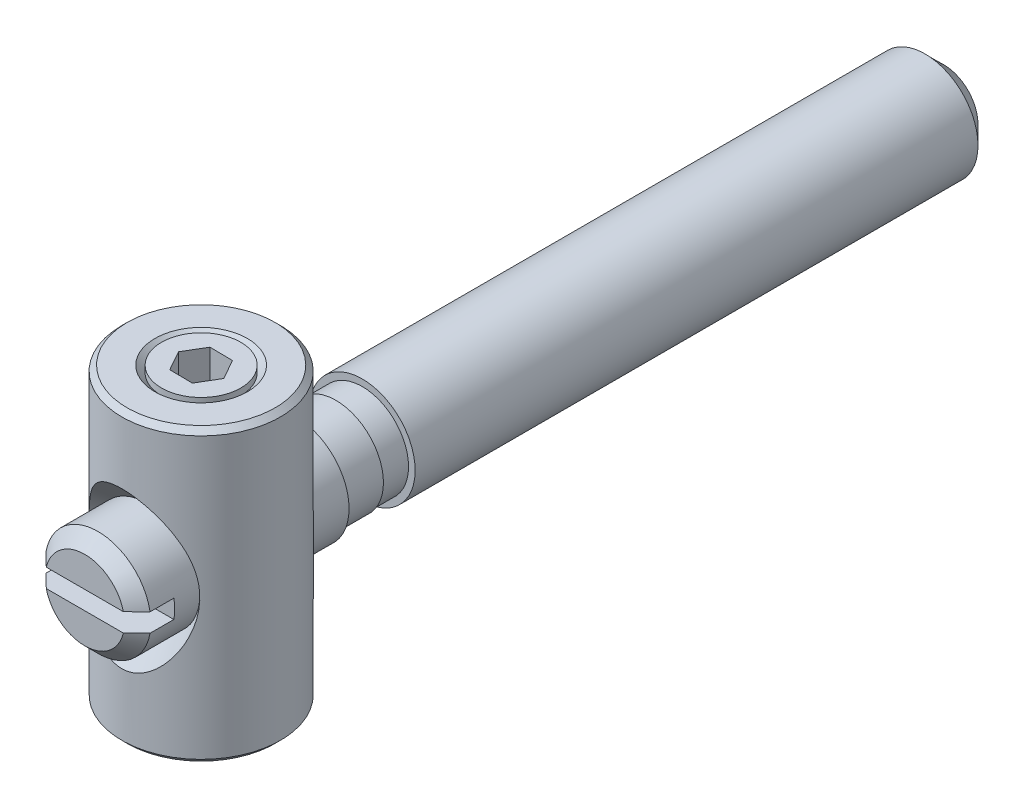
ISO-10303-21;
HEADER;
FILE_DESCRIPTION(('STEP AP214'),'2;1');
FILE_NAME('part.step','',(''),(''),'','','');
FILE_SCHEMA(('AUTOMOTIVE_DESIGN { 1 0 10303 214 1 1 1 1 }'));
ENDSEC;
DATA;
#1=APPLICATION_CONTEXT('core data for automotive mechanical design processes');
#2=APPLICATION_PROTOCOL_DEFINITION('international standard','automotive_design',2000,#1);
#3=PRODUCT_CONTEXT('',#1,'mechanical');
#4=PRODUCT('Part','Part','',(#3));
#5=PRODUCT_RELATED_PRODUCT_CATEGORY('part','',(#4));
#6=PRODUCT_DEFINITION_FORMATION('','',#4);
#7=PRODUCT_DEFINITION_CONTEXT('part definition',#1,'design');
#8=PRODUCT_DEFINITION('design','',#6,#7);
#9=PRODUCT_DEFINITION_SHAPE('','',#8);
#10=(LENGTH_UNIT() NAMED_UNIT(*) SI_UNIT(.MILLI.,.METRE.));
#11=(NAMED_UNIT(*) PLANE_ANGLE_UNIT() SI_UNIT($,.RADIAN.));
#12=(NAMED_UNIT(*) SI_UNIT($,.STERADIAN.) SOLID_ANGLE_UNIT());
#13=UNCERTAINTY_MEASURE_WITH_UNIT(LENGTH_MEASURE(1.E-05),#10,'distance_accuracy_value','');
#14=(GEOMETRIC_REPRESENTATION_CONTEXT(3) GLOBAL_UNCERTAINTY_ASSIGNED_CONTEXT((#13)) GLOBAL_UNIT_ASSIGNED_CONTEXT((#10,
#11,#12)) REPRESENTATION_CONTEXT('',''));
#15=CARTESIAN_POINT('',(0.,0.,0.));
#16=DIRECTION('',(0.,0.,1.));
#17=DIRECTION('',(1.,0.,0.));
#18=AXIS2_PLACEMENT_3D('',#15,#16,#17);
#19=CARTESIAN_POINT('',(0.,0.,34.697365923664));
#20=DIRECTION('',(0.,0.,1.));
#21=DIRECTION('',(1.,0.,0.));
#22=AXIS2_PLACEMENT_3D('',#19,#20,#21);
#23=CYLINDRICAL_SURFACE('',#22,2.);
#24=CARTESIAN_POINT('',(0.,0.,-27.398));
#25=DIRECTION('',(0.,0.,-1.));
#26=DIRECTION('',(0.,-1.,0.));
#27=AXIS2_PLACEMENT_3D('',#24,#25,#26);
#28=CIRCLE('',#27,2.);
#29=CARTESIAN_POINT('',(0.,-2.00000000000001,-27.398));
#30=VERTEX_POINT('',#29);
#31=EDGE_CURVE('E9',#30,#30,#28,.F.);
#32=ORIENTED_EDGE('',*,*,#31,.T.);
#33=EDGE_LOOP('',(#32));
#34=FACE_BOUND('',#33,.T.);
#35=CARTESIAN_POINT('',(0.,0.,-6.098));
#36=DIRECTION('',(0.,0.,1.));
#37=DIRECTION('',(1.,0.,0.));
#38=AXIS2_PLACEMENT_3D('',#35,#36,#37);
#39=CIRCLE('',#38,2.);
#40=CARTESIAN_POINT('',(2.,0.,-6.098));
#41=VERTEX_POINT('',#40);
#42=EDGE_CURVE('E283',#41,#41,#39,.T.);
#43=ORIENTED_EDGE('',*,*,#42,.F.);
#44=EDGE_LOOP('',(#43));
#45=FACE_BOUND('',#44,.T.);
#46=ADVANCED_FACE('F14',(#34,#45),#23,.T.);
#47=CARTESIAN_POINT('',(0.,0.,4.402));
#48=DIRECTION('',(0.,0.,-1.));
#49=DIRECTION('',(-1.,0.,0.));
#50=AXIS2_PLACEMENT_3D('',#47,#48,#49);
#51=PLANE('',#50);
#52=CARTESIAN_POINT('',(0.,0.,4.402));
#53=DIRECTION('',(0.,0.,-1.));
#54=DIRECTION('',(-1.,0.,0.));
#55=AXIS2_PLACEMENT_3D('',#52,#53,#54);
#56=CIRCLE('',#55,1.5);
#57=CARTESIAN_POINT('',(1.45859521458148,0.35,4.402));
#58=VERTEX_POINT('',#57);
#59=CARTESIAN_POINT('',(-1.45859521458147,0.35,4.402));
#60=VERTEX_POINT('',#59);
#61=EDGE_CURVE('E286',#58,#60,#56,.F.);
#62=ORIENTED_EDGE('',*,*,#61,.T.);
#63=DIRECTION('',(-1.,0.,0.));
#64=VECTOR('',#63,1.);
#65=CARTESIAN_POINT('',(-1.96913686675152,0.35,4.402));
#66=LINE('',#65,#64);
#67=EDGE_CURVE('E31',#58,#60,#66,.T.);
#68=ORIENTED_EDGE('',*,*,#67,.F.);
#69=EDGE_LOOP('',(#62,#68));
#70=FACE_BOUND('',#69,.T.);
#71=ADVANCED_FACE('F205',(#70),#51,.F.);
#72=CARTESIAN_POINT('',(-1.45859521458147,-0.35,4.402));
#73=VERTEX_POINT('',#72);
#74=CARTESIAN_POINT('',(1.45859521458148,-0.35,4.402));
#75=VERTEX_POINT('',#74);
#76=EDGE_CURVE('E292',#73,#75,#56,.F.);
#77=ORIENTED_EDGE('',*,*,#76,.T.);
#78=DIRECTION('',(1.,0.,0.));
#79=VECTOR('',#78,1.);
#80=CARTESIAN_POINT('',(-1.96913686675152,-0.35,4.402));
#81=LINE('',#80,#79);
#82=EDGE_CURVE('E324',#73,#75,#81,.T.);
#83=ORIENTED_EDGE('',*,*,#82,.F.);
#84=EDGE_LOOP('',(#77,#83));
#85=FACE_BOUND('',#84,.T.);
#86=ADVANCED_FACE('F212',(#85),#51,.F.);
#87=CARTESIAN_POINT('',(0.,0.,4.402));
#88=DIRECTION('',(0.,0.,-1.));
#89=DIRECTION('',(-1.,0.,0.));
#90=AXIS2_PLACEMENT_3D('',#87,#88,#89);
#91=CONICAL_SURFACE('',#90,1.5,0.785398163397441);
#92=CARTESIAN_POINT('',(4.35126885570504,0.349999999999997,1.53667748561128));
#93=CARTESIAN_POINT('',(4.19641291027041,0.35,1.69103028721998));
#94=CARTESIAN_POINT('',(4.04153476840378,0.350000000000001,1.84536085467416));
#95=CARTESIAN_POINT('',(3.73169612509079,0.350000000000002,2.15395346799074));
#96=CARTESIAN_POINT('',(3.57673562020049,0.350000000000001,2.30821551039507));
#97=CARTESIAN_POINT('',(3.2665365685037,0.350000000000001,2.616803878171));
#98=CARTESIAN_POINT('',(3.11129790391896,0.350000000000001,2.77113008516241));
#99=CARTESIAN_POINT('',(2.8006638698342,0.350000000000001,3.07961097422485));
#100=CARTESIAN_POINT('',(2.64526850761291,0.350000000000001,3.23376566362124));
#101=CARTESIAN_POINT('',(2.34228144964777,0.350000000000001,3.5338017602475));
#102=CARTESIAN_POINT('',(2.19470355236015,0.350000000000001,3.67969710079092));
#103=CARTESIAN_POINT('',(1.89910586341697,0.350000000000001,3.97107818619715));
#104=CARTESIAN_POINT('',(1.7510860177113,0.350000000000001,4.11656387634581));
#105=CARTESIAN_POINT('',(1.52844687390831,0.350000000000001,4.33406929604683));
#106=CARTESIAN_POINT('',(1.45415744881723,0.350000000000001,4.40642627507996));
#107=CARTESIAN_POINT('',(1.30522725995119,0.350000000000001,4.55078536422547));
#108=CARTESIAN_POINT('',(1.23058647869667,0.350000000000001,4.62278745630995));
#109=CARTESIAN_POINT('',(1.08076094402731,0.350000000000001,4.76619144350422));
#110=CARTESIAN_POINT('',(1.00557632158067,0.350000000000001,4.83759347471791));
#111=CARTESIAN_POINT('',(0.892022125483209,0.350000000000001,4.94386077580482));
#112=CARTESIAN_POINT('',(0.85404275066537,0.350000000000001,4.97914249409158));
#113=CARTESIAN_POINT('',(0.777709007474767,0.350000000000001,5.04929736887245));
#114=CARTESIAN_POINT('',(0.73935465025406,0.35,5.08417053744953));
#115=CARTESIAN_POINT('',(0.679196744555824,0.35,5.13798633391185));
#116=CARTESIAN_POINT('',(0.657585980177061,0.350000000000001,5.15714426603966));
#117=CARTESIAN_POINT('',(0.614138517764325,0.350000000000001,5.19520729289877));
#118=CARTESIAN_POINT('',(0.592301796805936,0.350000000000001,5.21411236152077));
#119=CARTESIAN_POINT('',(0.548146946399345,0.350000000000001,5.25174589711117));
#120=CARTESIAN_POINT('',(0.525826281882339,0.350000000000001,5.27047139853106));
#121=CARTESIAN_POINT('',(0.480797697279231,0.350000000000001,5.3074405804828));
#122=CARTESIAN_POINT('',(0.458089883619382,0.35,5.3256843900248));
#123=CARTESIAN_POINT('',(0.411906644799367,0.35,5.36167156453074));
#124=CARTESIAN_POINT('',(0.388425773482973,0.350000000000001,5.37940798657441));
#125=CARTESIAN_POINT('',(0.340709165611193,0.350000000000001,5.41383103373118));
#126=CARTESIAN_POINT('',(0.316473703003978,0.350000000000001,5.43051803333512));
#127=CARTESIAN_POINT('',(0.267118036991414,0.350000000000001,5.46212071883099));
#128=CARTESIAN_POINT('',(0.242006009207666,0.350000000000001,5.47704896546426));
#129=CARTESIAN_POINT('',(0.190376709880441,0.350000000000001,5.50417839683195));
#130=CARTESIAN_POINT('',(0.16386395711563,0.35,5.51638775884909));
#131=CARTESIAN_POINT('',(0.115662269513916,0.35,5.53389096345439));
#132=CARTESIAN_POINT('',(0.0943343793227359,0.350000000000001,5.54014013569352));
#133=CARTESIAN_POINT('',(0.050967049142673,0.350000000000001,5.54893856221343));
#134=CARTESIAN_POINT('',(0.0289307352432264,0.35,5.55150226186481));
#135=CARTESIAN_POINT('',(-0.0153473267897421,0.35,5.55236596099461));
#136=CARTESIAN_POINT('',(-0.0375895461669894,0.350000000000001,5.55064352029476));
#137=CARTESIAN_POINT('',(-0.0814521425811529,0.350000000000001,5.54330655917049));
#138=CARTESIAN_POINT('',(-0.10307022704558,0.35,5.53767922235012));
#139=CARTESIAN_POINT('',(-0.146000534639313,0.35,5.52332975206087));
#140=CARTESIAN_POINT('',(-0.167279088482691,0.350000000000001,5.51451156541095));
#141=CARTESIAN_POINT('',(-0.208879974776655,0.350000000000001,5.49482143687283));
#142=CARTESIAN_POINT('',(-0.229200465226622,0.350000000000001,5.48394572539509));
#143=CARTESIAN_POINT('',(-0.269207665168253,0.350000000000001,5.46074603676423));
#144=CARTESIAN_POINT('',(-0.288887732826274,0.350000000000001,5.44841081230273));
#145=CARTESIAN_POINT('',(-0.327605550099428,0.350000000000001,5.42281699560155));
#146=CARTESIAN_POINT('',(-0.346643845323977,0.35,5.40955921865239));
#147=CARTESIAN_POINT('',(-0.40644569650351,0.35,5.36638652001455));
#148=CARTESIAN_POINT('',(-0.446338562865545,0.35,5.33527476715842));
#149=CARTESIAN_POINT('',(-0.524892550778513,0.350000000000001,5.27152437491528));
#150=CARTESIAN_POINT('',(-0.563552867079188,0.350000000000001,5.23888477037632));
#151=CARTESIAN_POINT('',(-0.640169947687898,0.35,5.17265387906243));
#152=CARTESIAN_POINT('',(-0.678125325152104,0.350000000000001,5.1390609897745));
#153=CARTESIAN_POINT('',(-0.753518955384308,0.350000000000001,5.07132508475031));
#154=CARTESIAN_POINT('',(-0.790957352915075,0.350000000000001,5.03718222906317));
#155=CARTESIAN_POINT('',(-0.902510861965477,0.35,4.93443874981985));
#156=CARTESIAN_POINT('',(-0.976123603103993,0.350000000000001,4.86529362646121));
#157=CARTESIAN_POINT('',(-1.12257494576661,0.35,4.72634664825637));
#158=CARTESIAN_POINT('',(-1.19541427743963,0.35,4.65654555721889));
#159=CARTESIAN_POINT('',(-1.39829359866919,0.35,4.46099580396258));
#160=CARTESIAN_POINT('',(-1.52788326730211,0.35,4.33478022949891));
#161=CARTESIAN_POINT('',(-1.78647544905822,0.35,4.08174671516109));
#162=CARTESIAN_POINT('',(-1.91547795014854,0.35,3.95492876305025));
#163=CARTESIAN_POINT('',(-2.17321511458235,0.35,3.70088959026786));
#164=CARTESIAN_POINT('',(-2.30194960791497,0.35,3.57366819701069));
#165=CARTESIAN_POINT('',(-2.55921717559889,0.35,3.31902418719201));
#166=CARTESIAN_POINT('',(-2.68775025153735,0.35,3.19160157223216));
#167=CARTESIAN_POINT('',(-3.07247665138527,0.35,2.80981746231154));
#168=CARTESIAN_POINT('',(-3.32848011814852,0.349999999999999,2.55526465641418));
#169=CARTESIAN_POINT('',(-3.71223239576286,0.35,2.17332351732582));
#170=CARTESIAN_POINT('',(-3.84007220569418,0.35,2.04602651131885));
#171=CARTESIAN_POINT('',(-4.09570351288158,0.349999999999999,1.79138474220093));
#172=CARTESIAN_POINT('',(-4.22349501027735,0.349999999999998,1.66403997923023));
#173=CARTESIAN_POINT('',(-4.35126885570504,0.349999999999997,1.53667748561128));
#174=B_SPLINE_CURVE_WITH_KNOTS('',3,(#92,#93,#94,#95,#96,#97,#98,#99,#100,#101,#102,#103,#104,
#105,#106,#107,#108,#109,#110,#111,#112,#113,#114,#115,#116,#117,#118,#119,#120,#121,#122,#123,
#124,#125,#126,#127,#128,#129,#130,#131,#132,#133,#134,#135,#136,#137,#138,#139,#140,#141,#142,
#143,#144,#145,#146,#147,#148,#149,#150,#151,#152,#153,#154,#155,#156,#157,#158,#159,#160,#161,
#162,#163,#164,#165,#166,#167,#168,#169,#170,#171,#172,#173),.UNSPECIFIED.,.F.,.F.,(4,2,2,2,2,2,
2,2,2,2,2,2,2,2,2,2,2,2,2,2,2,2,2,2,2,2,2,2,2,2,2,2,2,2,2,2,2,2,2,2,4),(0.,0.655931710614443,
1.31189343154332,1.96858248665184,2.62524232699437,3.24780305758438,3.87044333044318,
4.18155345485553,4.49267922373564,4.80373240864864,4.95924629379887,5.1147555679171,
5.20139397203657,5.28804125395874,5.37544205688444,5.46281920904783,5.55108162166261,
5.63931235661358,5.72686889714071,5.81415843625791,5.88059131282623,5.94676308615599,
6.0132820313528,6.08002033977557,6.14896231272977,6.21803183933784,6.28767333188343,
6.3572540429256,6.50893272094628,6.66070854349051,6.812756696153,6.9647613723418,
7.26773191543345,7.57038509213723,8.11307078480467,8.65576754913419,9.19874089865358,
9.74170994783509,10.8247672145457,11.3659953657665,11.9072219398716),.UNSPECIFIED.);
#175=CARTESIAN_POINT('',(1.96913686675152,0.35,3.902));
#176=VERTEX_POINT('',#175);
#177=EDGE_CURVE('E242',#176,#58,#174,.T.);
#178=ORIENTED_EDGE('',*,*,#177,.F.);
#179=CARTESIAN_POINT('',(0.,0.,3.902));
#180=DIRECTION('',(0.,0.,-1.));
#181=DIRECTION('',(-1.,0.,0.));
#182=AXIS2_PLACEMENT_3D('',#179,#180,#181);
#183=CIRCLE('',#182,2.);
#184=CARTESIAN_POINT('',(-1.96913686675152,0.35,3.902));
#185=VERTEX_POINT('',#184);
#186=EDGE_CURVE('E295',#185,#176,#183,.T.);
#187=ORIENTED_EDGE('',*,*,#186,.F.);
#188=EDGE_CURVE('E229',#60,#185,#174,.T.);
#189=ORIENTED_EDGE('',*,*,#188,.F.);
#190=ORIENTED_EDGE('',*,*,#61,.F.);
#191=EDGE_LOOP('',(#178,#187,#189,#190));
#192=FACE_BOUND('',#191,.T.);
#193=ADVANCED_FACE('F220',(#192),#91,.T.);
#194=CARTESIAN_POINT('',(-1.96913686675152,0.35,3.002));
#195=DIRECTION('',(0.,1.,0.));
#196=DIRECTION('',(-1.,0.,0.));
#197=AXIS2_PLACEMENT_3D('',#194,#195,#196);
#198=PLANE('',#197);
#199=ORIENTED_EDGE('',*,*,#177,.T.);
#200=ORIENTED_EDGE('',*,*,#67,.T.);
#201=ORIENTED_EDGE('',*,*,#188,.T.);
#202=DIRECTION('',(0.,0.,1.));
#203=VECTOR('',#202,1.);
#204=CARTESIAN_POINT('',(-1.96913686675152,0.35,3.002));
#205=LINE('',#204,#203);
#206=CARTESIAN_POINT('',(-1.96913686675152,0.35,3.002));
#207=VERTEX_POINT('',#206);
#208=EDGE_CURVE('E341',#207,#185,#205,.T.);
#209=ORIENTED_EDGE('',*,*,#208,.F.);
#210=DIRECTION('',(-1.,0.,0.));
#211=VECTOR('',#210,1.);
#212=CARTESIAN_POINT('',(-1.96913686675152,0.35,3.002));
#213=LINE('',#212,#211);
#214=CARTESIAN_POINT('',(1.96913686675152,0.35,3.002));
#215=VERTEX_POINT('',#214);
#216=EDGE_CURVE('E332',#215,#207,#213,.T.);
#217=ORIENTED_EDGE('',*,*,#216,.F.);
#218=DIRECTION('',(0.,0.,1.));
#219=VECTOR('',#218,1.);
#220=CARTESIAN_POINT('',(1.96913686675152,0.35,3.002));
#221=LINE('',#220,#219);
#222=EDGE_CURVE('E343',#215,#176,#221,.T.);
#223=ORIENTED_EDGE('',*,*,#222,.T.);
#224=EDGE_LOOP('',(#199,#200,#201,#209,#217,#223));
#225=FACE_BOUND('',#224,.T.);
#226=ADVANCED_FACE('F224',(#225),#198,.F.);
#227=CARTESIAN_POINT('',(0.,0.,3.002));
#228=DIRECTION('',(0.,0.,1.));
#229=DIRECTION('',(1.,0.,0.));
#230=AXIS2_PLACEMENT_3D('',#227,#228,#229);
#231=PLANE('',#230);
#232=CARTESIAN_POINT('',(0.,0.,3.002));
#233=DIRECTION('',(0.,0.,1.));
#234=DIRECTION('',(1.,0.,0.));
#235=AXIS2_PLACEMENT_3D('',#232,#233,#234);
#236=CIRCLE('',#235,2.);
#237=CARTESIAN_POINT('',(1.96913686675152,-0.35,3.002));
#238=VERTEX_POINT('',#237);
#239=EDGE_CURVE('E329',#238,#215,#236,.T.);
#240=ORIENTED_EDGE('',*,*,#239,.T.);
#241=ORIENTED_EDGE('',*,*,#216,.T.);
#242=CARTESIAN_POINT('',(0.,0.,3.002));
#243=DIRECTION('',(0.,0.,1.));
#244=DIRECTION('',(1.,0.,0.));
#245=AXIS2_PLACEMENT_3D('',#242,#243,#244);
#246=CIRCLE('',#245,2.);
#247=CARTESIAN_POINT('',(-1.96913686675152,-0.35,3.002));
#248=VERTEX_POINT('',#247);
#249=EDGE_CURVE('E362',#207,#248,#246,.T.);
#250=ORIENTED_EDGE('',*,*,#249,.T.);
#251=DIRECTION('',(1.,0.,0.));
#252=VECTOR('',#251,1.);
#253=CARTESIAN_POINT('',(-1.96913686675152,-0.35,3.002));
#254=LINE('',#253,#252);
#255=EDGE_CURVE('E346',#248,#238,#254,.T.);
#256=ORIENTED_EDGE('',*,*,#255,.T.);
#257=EDGE_LOOP('',(#240,#241,#250,#256));
#258=FACE_BOUND('',#257,.T.);
#259=ADVANCED_FACE('F247',(#258),#231,.T.);
#260=CARTESIAN_POINT('',(-1.96913686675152,-0.35,3.002));
#261=DIRECTION('',(0.,-1.,0.));
#262=DIRECTION('',(1.,0.,0.));
#263=AXIS2_PLACEMENT_3D('',#260,#261,#262);
#264=PLANE('',#263);
#265=CARTESIAN_POINT('',(-4.35126885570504,-0.35,1.53667748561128));
#266=CARTESIAN_POINT('',(-4.19641291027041,-0.35,1.69103028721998));
#267=CARTESIAN_POINT('',(-4.04153476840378,-0.35,1.84536085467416));
#268=CARTESIAN_POINT('',(-3.73169612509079,-0.35,2.15395346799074));
#269=CARTESIAN_POINT('',(-3.57673562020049,-0.35,2.30821551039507));
#270=CARTESIAN_POINT('',(-3.2665365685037,-0.35,2.616803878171));
#271=CARTESIAN_POINT('',(-3.11129790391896,-0.35,2.77113008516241));
#272=CARTESIAN_POINT('',(-2.80066386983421,-0.35,3.07961097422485));
#273=CARTESIAN_POINT('',(-2.64526850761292,-0.35,3.23376566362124));
#274=CARTESIAN_POINT('',(-2.34228144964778,-0.35,3.53380176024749));
#275=CARTESIAN_POINT('',(-2.19470355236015,-0.35,3.67969710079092));
#276=CARTESIAN_POINT('',(-1.89910586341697,-0.35,3.97107818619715));
#277=CARTESIAN_POINT('',(-1.75108601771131,-0.35,4.11656387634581));
#278=CARTESIAN_POINT('',(-1.52844687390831,-0.35,4.33406929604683));
#279=CARTESIAN_POINT('',(-1.45415744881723,-0.35,4.40642627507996));
#280=CARTESIAN_POINT('',(-1.30522725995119,-0.35,4.55078536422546));
#281=CARTESIAN_POINT('',(-1.23058647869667,-0.35,4.62278745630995));
#282=CARTESIAN_POINT('',(-1.08076094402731,-0.35,4.76619144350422));
#283=CARTESIAN_POINT('',(-1.00557632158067,-0.35,4.83759347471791));
#284=CARTESIAN_POINT('',(-0.89202212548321,-0.35,4.94386077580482));
#285=CARTESIAN_POINT('',(-0.854042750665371,-0.35,4.97914249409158));
#286=CARTESIAN_POINT('',(-0.777709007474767,-0.35,5.04929736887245));
#287=CARTESIAN_POINT('',(-0.739354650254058,-0.35,5.08417053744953));
#288=CARTESIAN_POINT('',(-0.679196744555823,-0.35,5.13798633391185));
#289=CARTESIAN_POINT('',(-0.65758598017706,-0.35,5.15714426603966));
#290=CARTESIAN_POINT('',(-0.614138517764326,-0.35,5.19520729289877));
#291=CARTESIAN_POINT('',(-0.592301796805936,-0.35,5.21411236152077));
#292=CARTESIAN_POINT('',(-0.548146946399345,-0.35,5.25174589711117));
#293=CARTESIAN_POINT('',(-0.52582628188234,-0.35,5.27047139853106));
#294=CARTESIAN_POINT('',(-0.480797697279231,-0.35,5.30744058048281));
#295=CARTESIAN_POINT('',(-0.458089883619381,-0.35,5.3256843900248));
#296=CARTESIAN_POINT('',(-0.411906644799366,-0.35,5.36167156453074));
#297=CARTESIAN_POINT('',(-0.388425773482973,-0.35,5.37940798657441));
#298=CARTESIAN_POINT('',(-0.340709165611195,-0.35,5.41383103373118));
#299=CARTESIAN_POINT('',(-0.316473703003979,-0.35,5.43051803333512));
#300=CARTESIAN_POINT('',(-0.267118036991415,-0.35,5.46212071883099));
#301=CARTESIAN_POINT('',(-0.242006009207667,-0.35,5.47704896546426));
#302=CARTESIAN_POINT('',(-0.190376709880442,-0.35,5.50417839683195));
#303=CARTESIAN_POINT('',(-0.163863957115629,-0.35,5.51638775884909));
#304=CARTESIAN_POINT('',(-0.115662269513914,-0.35,5.53389096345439));
#305=CARTESIAN_POINT('',(-0.0943343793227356,-0.35,5.54014013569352));
#306=CARTESIAN_POINT('',(-0.050967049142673,-0.35,5.54893856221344));
#307=CARTESIAN_POINT('',(-0.0289307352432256,-0.35,5.55150226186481));
#308=CARTESIAN_POINT('',(0.0153473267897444,-0.35,5.55236596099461));
#309=CARTESIAN_POINT('',(0.0375895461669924,-0.35,5.55064352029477));
#310=CARTESIAN_POINT('',(0.0814521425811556,-0.35,5.5433065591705));
#311=CARTESIAN_POINT('',(0.103070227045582,-0.35,5.53767922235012));
#312=CARTESIAN_POINT('',(0.146000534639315,-0.35,5.52332975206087));
#313=CARTESIAN_POINT('',(0.167279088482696,-0.35,5.51451156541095));
#314=CARTESIAN_POINT('',(0.208879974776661,-0.35,5.49482143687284));
#315=CARTESIAN_POINT('',(0.229200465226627,-0.35,5.4839457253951));
#316=CARTESIAN_POINT('',(0.269207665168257,-0.35,5.46074603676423));
#317=CARTESIAN_POINT('',(0.288887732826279,-0.35,5.44841081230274));
#318=CARTESIAN_POINT('',(0.327605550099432,-0.35,5.42281699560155));
#319=CARTESIAN_POINT('',(0.34664384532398,-0.35,5.40955921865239));
#320=CARTESIAN_POINT('',(0.406445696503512,-0.35,5.36638652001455));
#321=CARTESIAN_POINT('',(0.446338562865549,-0.35,5.33527476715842));
#322=CARTESIAN_POINT('',(0.524892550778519,-0.35,5.27152437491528));
#323=CARTESIAN_POINT('',(0.563552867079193,-0.35,5.23888477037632));
#324=CARTESIAN_POINT('',(0.640169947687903,-0.35,5.17265387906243));
#325=CARTESIAN_POINT('',(0.678125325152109,-0.35,5.1390609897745));
#326=CARTESIAN_POINT('',(0.753518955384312,-0.35,5.07132508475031));
#327=CARTESIAN_POINT('',(0.790957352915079,-0.35,5.03718222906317));
#328=CARTESIAN_POINT('',(0.902510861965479,-0.35,4.93443874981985));
#329=CARTESIAN_POINT('',(0.976123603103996,-0.35,4.86529362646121));
#330=CARTESIAN_POINT('',(1.12257494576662,-0.35,4.72634664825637));
#331=CARTESIAN_POINT('',(1.19541427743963,-0.35,4.65654555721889));
#332=CARTESIAN_POINT('',(1.39829359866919,-0.35,4.46099580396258));
#333=CARTESIAN_POINT('',(1.52788326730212,-0.35,4.33478022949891));
#334=CARTESIAN_POINT('',(1.78647544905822,-0.35,4.08174671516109));
#335=CARTESIAN_POINT('',(1.91547795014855,-0.35,3.95492876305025));
#336=CARTESIAN_POINT('',(2.17321511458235,-0.35,3.70088959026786));
#337=CARTESIAN_POINT('',(2.30194960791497,-0.35,3.57366819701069));
#338=CARTESIAN_POINT('',(2.55921717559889,-0.35,3.31902418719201));
#339=CARTESIAN_POINT('',(2.68775025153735,-0.35,3.19160157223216));
#340=CARTESIAN_POINT('',(3.07247665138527,-0.35,2.80981746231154));
#341=CARTESIAN_POINT('',(3.32848011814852,-0.35,2.55526465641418));
#342=CARTESIAN_POINT('',(3.71223239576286,-0.35,2.17332351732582));
#343=CARTESIAN_POINT('',(3.84007220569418,-0.35,2.04602651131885));
#344=CARTESIAN_POINT('',(4.09570351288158,-0.35,1.79138474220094));
#345=CARTESIAN_POINT('',(4.22349501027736,-0.35,1.66403997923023));
#346=CARTESIAN_POINT('',(4.35126885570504,-0.35,1.53667748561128));
#347=B_SPLINE_CURVE_WITH_KNOTS('',3,(#265,#266,#267,#268,#269,#270,#271,#272,#273,#274,#275,
#276,#277,#278,#279,#280,#281,#282,#283,#284,#285,#286,#287,#288,#289,#290,#291,#292,#293,#294,
#295,#296,#297,#298,#299,#300,#301,#302,#303,#304,#305,#306,#307,#308,#309,#310,#311,#312,#313,
#314,#315,#316,#317,#318,#319,#320,#321,#322,#323,#324,#325,#326,#327,#328,#329,#330,#331,#332,
#333,#334,#335,#336,#337,#338,#339,#340,#341,#342,#343,#344,#345,#346),.UNSPECIFIED.,.F.,.F.,(4,
2,2,2,2,2,2,2,2,2,2,2,2,2,2,2,2,2,2,2,2,2,2,2,2,2,2,2,2,2,2,2,2,2,2,2,2,2,2,2,4),(0.,
0.655931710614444,1.31189343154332,1.96858248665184,2.62524232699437,3.24780305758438,
3.87044333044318,4.18155345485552,4.49267922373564,4.80373240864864,4.95924629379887,
5.1147555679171,5.20139397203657,5.28804125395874,5.37544205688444,5.46281920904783,
5.55108162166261,5.63931235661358,5.72686889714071,5.81415843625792,5.88059131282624,
5.946763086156,6.0132820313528,6.08002033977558,6.14896231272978,6.21803183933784,
6.28767333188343,6.35725404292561,6.50893272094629,6.66070854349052,6.812756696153,
6.96476137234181,7.26773191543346,7.57038509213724,8.11307078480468,8.65576754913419,
9.19874089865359,9.7417099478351,10.8247672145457,11.3659953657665,11.9072219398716),.UNSPECIFIED.);
#348=CARTESIAN_POINT('',(-1.96913686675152,-0.35,3.902));
#349=VERTEX_POINT('',#348);
#350=EDGE_CURVE('E134',#349,#73,#347,.T.);
#351=ORIENTED_EDGE('',*,*,#350,.T.);
#352=ORIENTED_EDGE('',*,*,#82,.T.);
#353=CARTESIAN_POINT('',(1.96913686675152,-0.35,3.902));
#354=VERTEX_POINT('',#353);
#355=EDGE_CURVE('E236',#75,#354,#347,.T.);
#356=ORIENTED_EDGE('',*,*,#355,.T.);
#357=DIRECTION('',(0.,0.,1.));
#358=VECTOR('',#357,1.);
#359=CARTESIAN_POINT('',(1.96913686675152,-0.35,3.002));
#360=LINE('',#359,#358);
#361=EDGE_CURVE('E313',#238,#354,#360,.T.);
#362=ORIENTED_EDGE('',*,*,#361,.F.);
#363=ORIENTED_EDGE('',*,*,#255,.F.);
#364=DIRECTION('',(0.,0.,1.));
#365=VECTOR('',#364,1.);
#366=CARTESIAN_POINT('',(-1.96913686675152,-0.35,3.002));
#367=LINE('',#366,#365);
#368=EDGE_CURVE('E310',#248,#349,#367,.T.);
#369=ORIENTED_EDGE('',*,*,#368,.T.);
#370=EDGE_LOOP('',(#351,#352,#356,#362,#363,#369));
#371=FACE_BOUND('',#370,.T.);
#372=ADVANCED_FACE('F243',(#371),#264,.F.);
#373=ORIENTED_EDGE('',*,*,#350,.F.);
#374=EDGE_CURVE('E294',#354,#349,#183,.T.);
#375=ORIENTED_EDGE('',*,*,#374,.F.);
#376=ORIENTED_EDGE('',*,*,#355,.F.);
#377=ORIENTED_EDGE('',*,*,#76,.F.);
#378=EDGE_LOOP('',(#373,#375,#376,#377));
#379=FACE_BOUND('',#378,.T.);
#380=ADVANCED_FACE('F226',(#379),#91,.T.);
#381=CARTESIAN_POINT('',(0.,0.,34.697365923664));
#382=DIRECTION('',(0.,0.,1.));
#383=DIRECTION('',(1.,0.,0.));
#384=AXIS2_PLACEMENT_3D('',#381,#382,#383);
#385=CYLINDRICAL_SURFACE('',#384,2.);
#386=ORIENTED_EDGE('',*,*,#374,.T.);
#387=ORIENTED_EDGE('',*,*,#368,.F.);
#388=ORIENTED_EDGE('',*,*,#249,.F.);
#389=ORIENTED_EDGE('',*,*,#208,.T.);
#390=ORIENTED_EDGE('',*,*,#186,.T.);
#391=ORIENTED_EDGE('',*,*,#222,.F.);
#392=ORIENTED_EDGE('',*,*,#239,.F.);
#393=ORIENTED_EDGE('',*,*,#361,.T.);
#394=EDGE_LOOP('',(#386,#387,#388,#389,#390,#391,#392,#393));
#395=FACE_BOUND('',#394,.T.);
#396=CARTESIAN_POINT('',(0.,0.,2.05));
#397=DIRECTION('',(0.,0.,1.));
#398=DIRECTION('',(1.,0.,0.));
#399=AXIS2_PLACEMENT_3D('',#396,#397,#398);
#400=CIRCLE('',#399,2.);
#401=CARTESIAN_POINT('',(2.,0.,2.05));
#402=VERTEX_POINT('',#401);
#403=EDGE_CURVE('E129',#402,#402,#400,.F.);
#404=ORIENTED_EDGE('',*,*,#403,.F.);
#405=EDGE_LOOP('',(#404));
#406=FACE_BOUND('',#405,.T.);
#407=ADVANCED_FACE('F256',(#395,#406),#385,.T.);
#408=CARTESIAN_POINT('',(0.,0.,-3.598));
#409=DIRECTION('',(0.,0.,1.));
#410=DIRECTION('',(1.,0.,0.));
#411=AXIS2_PLACEMENT_3D('',#408,#409,#410);
#412=CIRCLE('',#411,2.);
#413=CARTESIAN_POINT('',(2.,0.,-3.598));
#414=VERTEX_POINT('',#413);
#415=EDGE_CURVE('E339',#414,#414,#412,.T.);
#416=ORIENTED_EDGE('',*,*,#415,.T.);
#417=EDGE_LOOP('',(#416));
#418=FACE_BOUND('',#417,.T.);
#419=CARTESIAN_POINT('',(0.,0.,-2.05));
#420=DIRECTION('',(0.,0.,-1.));
#421=DIRECTION('',(-1.,0.,0.));
#422=AXIS2_PLACEMENT_3D('',#419,#420,#421);
#423=CIRCLE('',#422,2.);
#424=CARTESIAN_POINT('',(-2.,0.,-2.05));
#425=VERTEX_POINT('',#424);
#426=EDGE_CURVE('E125',#425,#425,#423,.F.);
#427=ORIENTED_EDGE('',*,*,#426,.F.);
#428=EDGE_LOOP('',(#427));
#429=FACE_BOUND('',#428,.T.);
#430=ADVANCED_FACE('F253',(#418,#429),#385,.T.);
#431=CARTESIAN_POINT('',(0.,1.75,-6.098));
#432=DIRECTION('',(0.,0.,-1.));
#433=DIRECTION('',(-1.,0.,0.));
#434=AXIS2_PLACEMENT_3D('',#431,#432,#433);
#435=PLANE('',#434);
#436=CARTESIAN_POINT('',(0.,0.,-6.098));
#437=DIRECTION('',(0.,0.,1.));
#438=DIRECTION('',(1.,0.,0.));
#439=AXIS2_PLACEMENT_3D('',#436,#437,#438);
#440=CIRCLE('',#439,1.75);
#441=CARTESIAN_POINT('',(1.75,0.,-6.098));
#442=VERTEX_POINT('',#441);
#443=EDGE_CURVE('E282',#442,#442,#440,.T.);
#444=ORIENTED_EDGE('',*,*,#443,.F.);
#445=EDGE_LOOP('',(#444));
#446=FACE_BOUND('',#445,.T.);
#447=ORIENTED_EDGE('',*,*,#42,.T.);
#448=EDGE_LOOP('',(#447));
#449=FACE_BOUND('',#448,.T.);
#450=ADVANCED_FACE('F218',(#446,#449),#435,.F.);
#451=CARTESIAN_POINT('',(0.,0.,34.697365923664));
#452=DIRECTION('',(0.,0.,1.));
#453=DIRECTION('',(1.,0.,0.));
#454=AXIS2_PLACEMENT_3D('',#451,#452,#453);
#455=CYLINDRICAL_SURFACE('',#454,1.75);
#456=CARTESIAN_POINT('',(0.,0.,-5.098));
#457=DIRECTION('',(0.,0.,1.));
#458=DIRECTION('',(1.,0.,0.));
#459=AXIS2_PLACEMENT_3D('',#456,#457,#458);
#460=CIRCLE('',#459,1.75);
#461=CARTESIAN_POINT('',(1.75,0.,-5.098));
#462=VERTEX_POINT('',#461);
#463=EDGE_CURVE('E279',#462,#462,#460,.T.);
#464=ORIENTED_EDGE('',*,*,#463,.F.);
#465=EDGE_LOOP('',(#464));
#466=FACE_BOUND('',#465,.T.);
#467=ORIENTED_EDGE('',*,*,#443,.T.);
#468=EDGE_LOOP('',(#467));
#469=FACE_BOUND('',#468,.T.);
#470=ADVANCED_FACE('F267',(#466,#469),#455,.T.);
#471=CARTESIAN_POINT('',(0.,1.75,-5.098));
#472=DIRECTION('',(0.,0.,1.));
#473=DIRECTION('',(1.,0.,0.));
#474=AXIS2_PLACEMENT_3D('',#471,#472,#473);
#475=PLANE('',#474);
#476=CARTESIAN_POINT('',(0.,0.,-5.098));
#477=DIRECTION('',(0.,0.,1.));
#478=DIRECTION('',(1.,0.,0.));
#479=AXIS2_PLACEMENT_3D('',#476,#477,#478);
#480=CIRCLE('',#479,1.8);
#481=CARTESIAN_POINT('',(1.8,0.,-5.098));
#482=VERTEX_POINT('',#481);
#483=EDGE_CURVE('E288',#482,#482,#480,.T.);
#484=ORIENTED_EDGE('',*,*,#483,.F.);
#485=EDGE_LOOP('',(#484));
#486=FACE_BOUND('',#485,.T.);
#487=ORIENTED_EDGE('',*,*,#463,.T.);
#488=EDGE_LOOP('',(#487));
#489=FACE_BOUND('',#488,.T.);
#490=ADVANCED_FACE('F264',(#486,#489),#475,.F.);
#491=CARTESIAN_POINT('',(0.,0.,34.697365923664));
#492=DIRECTION('',(0.,0.,1.));
#493=DIRECTION('',(1.,0.,0.));
#494=AXIS2_PLACEMENT_3D('',#491,#492,#493);
#495=CYLINDRICAL_SURFACE('',#494,1.8);
#496=CARTESIAN_POINT('',(0.,0.,-3.598));
#497=DIRECTION('',(0.,0.,1.));
#498=DIRECTION('',(1.,0.,0.));
#499=AXIS2_PLACEMENT_3D('',#496,#497,#498);
#500=CIRCLE('',#499,1.8);
#501=CARTESIAN_POINT('',(1.8,0.,-3.598));
#502=VERTEX_POINT('',#501);
#503=EDGE_CURVE('E349',#502,#502,#500,.T.);
#504=ORIENTED_EDGE('',*,*,#503,.F.);
#505=EDGE_LOOP('',(#504));
#506=FACE_BOUND('',#505,.T.);
#507=ORIENTED_EDGE('',*,*,#483,.T.);
#508=EDGE_LOOP('',(#507));
#509=FACE_BOUND('',#508,.T.);
#510=ADVANCED_FACE('F260',(#506,#509),#495,.T.);
#511=CARTESIAN_POINT('',(0.,1.8,-3.598));
#512=DIRECTION('',(0.,0.,1.));
#513=DIRECTION('',(1.,0.,0.));
#514=AXIS2_PLACEMENT_3D('',#511,#512,#513);
#515=PLANE('',#514);
#516=ORIENTED_EDGE('',*,*,#415,.F.);
#517=EDGE_LOOP('',(#516));
#518=FACE_BOUND('',#517,.T.);
#519=ORIENTED_EDGE('',*,*,#503,.T.);
#520=EDGE_LOOP('',(#519));
#521=FACE_BOUND('',#520,.T.);
#522=ADVANCED_FACE('F177',(#518,#521),#515,.F.);
#523=CARTESIAN_POINT('',(0.,0.,-3.));
#524=DIRECTION('',(0.,0.,-1.));
#525=DIRECTION('',(0.,-1.,0.));
#526=AXIS2_PLACEMENT_3D('',#523,#524,#525);
#527=CONICAL_SURFACE('',#526,2.95,0.785398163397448);
#528=CARTESIAN_POINT('',(1.55574486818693,1.97618484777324,-2.56508516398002));
#529=CARTESIAN_POINT('',(1.49200000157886,2.07557437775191,-2.60374741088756));
#530=CARTESIAN_POINT('',(1.42218409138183,2.1709053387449,-2.64286056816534));
#531=CARTESIAN_POINT('',(1.26934325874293,2.3511378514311,-2.71957176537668));
#532=CARTESIAN_POINT('',(1.18632803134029,2.43604697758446,-2.75717089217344));
#533=CARTESIAN_POINT('',(1.02594664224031,2.57467109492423,-2.82013065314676));
#534=CARTESIAN_POINT('',(0.951327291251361,2.63114479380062,-2.84636788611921));
#535=CARTESIAN_POINT('',(0.793469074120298,2.73292367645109,-2.89433640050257));
#536=CARTESIAN_POINT('',(0.710241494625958,2.7782432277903,-2.91607347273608));
#537=CARTESIAN_POINT('',(0.550647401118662,2.84826344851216,-2.94996282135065));
#538=CARTESIAN_POINT('',(0.475459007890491,2.87514428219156,-2.96310984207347));
#539=CARTESIAN_POINT('',(0.321126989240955,2.91722348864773,-2.98377596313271));
#540=CARTESIAN_POINT('',(0.241986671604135,2.93243146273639,-2.99129968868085));
#541=CARTESIAN_POINT('',(0.0815590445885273,2.94994751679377,-2.99997048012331));
#542=CARTESIAN_POINT('',(0.000263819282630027,2.9521985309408,-3.00108933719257));
#543=CARTESIAN_POINT('',(-0.161429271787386,2.943434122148,-2.99674574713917));
#544=CARTESIAN_POINT('',(-0.24182697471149,2.93241633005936,-2.99128212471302));
#545=CARTESIAN_POINT('',(-0.394039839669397,2.89923486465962,-2.97493095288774));
#546=CARTESIAN_POINT('',(-0.466071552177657,2.87785284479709,-2.96442422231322));
#547=CARTESIAN_POINT('',(-0.605828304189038,2.82577461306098,-2.93905193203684));
#548=CARTESIAN_POINT('',(-0.673551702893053,2.79507487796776,-2.9241847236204));
#549=CARTESIAN_POINT('',(-0.836074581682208,2.70883188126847,-2.88289064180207));
#550=CARTESIAN_POINT('',(-0.927800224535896,2.64849715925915,-2.85437537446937));
#551=CARTESIAN_POINT('',(-1.09954127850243,2.51486905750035,-2.79273775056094));
#552=CARTESIAN_POINT('',(-1.17952498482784,2.44154173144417,-2.75960337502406));
#553=CARTESIAN_POINT('',(-1.3625587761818,2.24911914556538,-2.6753985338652));
#554=CARTESIAN_POINT('',(-1.4592314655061,2.12451397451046,-2.62310446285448));
#555=CARTESIAN_POINT('',(-1.63098128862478,1.86077995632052,-2.5199087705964));
#556=CARTESIAN_POINT('',(-1.70602380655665,1.72162830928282,-2.46900949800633));
#557=CARTESIAN_POINT('',(-1.83864617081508,1.42677893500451,-2.37199476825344));
#558=CARTESIAN_POINT('',(-1.89546377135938,1.2706559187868,-2.32613097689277));
#559=CARTESIAN_POINT('',(-1.98829915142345,0.94927260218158,-2.2473125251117));
#560=CARTESIAN_POINT('',(-2.02434028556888,0.784022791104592,-2.2143433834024));
#561=CARTESIAN_POINT('',(-2.06404822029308,0.522769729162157,-2.17716697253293));
#562=CARTESIAN_POINT('',(-2.07498463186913,0.428696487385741,-2.16668954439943));
#563=CARTESIAN_POINT('',(-2.09033557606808,0.239509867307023,-2.1518874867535));
#564=CARTESIAN_POINT('',(-2.09474995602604,0.144396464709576,-2.14756300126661));
#565=CARTESIAN_POINT('',(-2.09701113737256,-0.0459362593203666,-2.14535429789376));
#566=CARTESIAN_POINT('',(-2.09486091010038,-0.141155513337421,-2.14746716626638));
#567=CARTESIAN_POINT('',(-2.08402094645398,-0.330863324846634,-2.15798826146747));
#568=CARTESIAN_POINT('',(-2.0753314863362,-0.425351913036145,-2.16639622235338));
#569=CARTESIAN_POINT('',(-2.052826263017,-0.602227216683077,-2.18771882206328));
#570=CARTESIAN_POINT('',(-2.03969878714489,-0.684777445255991,-2.20001859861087));
#571=CARTESIAN_POINT('',(-2.00839905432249,-0.8482191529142,-2.22862722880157));
#572=CARTESIAN_POINT('',(-1.99022471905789,-0.929109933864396,-2.24493773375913));
#573=CARTESIAN_POINT('',(-1.92809425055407,-1.16899902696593,-2.29902073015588));
#574=CARTESIAN_POINT('',(-1.87655804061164,-1.32499765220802,-2.34191580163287));
#575=CARTESIAN_POINT('',(-1.78055846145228,-1.55869205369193,-2.41483888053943));
#576=CARTESIAN_POINT('',(-1.74318423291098,-1.64029239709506,-2.44207814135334));
#577=CARTESIAN_POINT('',(-1.66188767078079,-1.79961058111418,-2.498112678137));
#578=CARTESIAN_POINT('',(-1.61796328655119,-1.8773271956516,-2.52690843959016));
#579=CARTESIAN_POINT('',(-1.47608783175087,-2.10332867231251,-2.6140980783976));
#580=CARTESIAN_POINT('',(-1.36775810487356,-2.24516080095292,-2.67352355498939));
#581=CARTESIAN_POINT('',(-1.17516373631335,-2.44519042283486,-2.76128883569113));
#582=CARTESIAN_POINT('',(-1.10140298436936,-2.5126589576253,-2.7917658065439));
#583=CARTESIAN_POINT('',(-0.943845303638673,-2.63668940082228,-2.84888659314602));
#584=CARTESIAN_POINT('',(-0.86006368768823,-2.6932676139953,-2.87553612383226));
#585=CARTESIAN_POINT('',(-0.698871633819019,-2.78315905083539,-2.91842619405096));
#586=CARTESIAN_POINT('',(-0.623058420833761,-2.81883033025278,-2.93567787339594));
#587=CARTESIAN_POINT('',(-0.465902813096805,-2.87838445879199,-2.96467495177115));
#588=CARTESIAN_POINT('',(-0.384564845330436,-2.90227662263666,-2.9764247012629));
#589=CARTESIAN_POINT('',(-0.217694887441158,-2.93644134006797,-2.99327239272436));
#590=CARTESIAN_POINT('',(-0.132136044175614,-2.94661052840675,-2.99831984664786));
#591=CARTESIAN_POINT('',(0.0395564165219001,-2.95194869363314,-3.00096586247));
#592=CARTESIAN_POINT('',(0.125689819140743,-2.94712299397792,-2.99856706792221));
#593=CARTESIAN_POINT('',(0.285285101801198,-2.92443629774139,-2.98734927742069));
#594=CARTESIAN_POINT('',(0.359042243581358,-2.90818187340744,-2.97932186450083));
#595=CARTESIAN_POINT('',(0.502847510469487,-2.86561562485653,-2.95845095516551));
#596=CARTESIAN_POINT('',(0.572894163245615,-2.83929984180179,-2.94560556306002));
#597=CARTESIAN_POINT('',(0.734590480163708,-2.76617263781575,-2.91026416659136));
#598=CARTESIAN_POINT('',(0.824035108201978,-2.71537054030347,-2.88595794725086));
#599=CARTESIAN_POINT('',(0.992766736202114,-2.60109423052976,-2.83236621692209));
#600=CARTESIAN_POINT('',(1.07202948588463,-2.53759065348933,-2.80306919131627));
#601=CARTESIAN_POINT('',(1.25430967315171,-2.36989417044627,-2.72770765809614));
#602=CARTESIAN_POINT('',(1.35172004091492,-2.26033659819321,-2.68008040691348));
#603=CARTESIAN_POINT('',(1.52713535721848,-2.02703275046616,-2.5841566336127));
#604=CARTESIAN_POINT('',(1.60510930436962,-1.9032642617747,-2.53585917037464));
#605=CARTESIAN_POINT('',(1.74629197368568,-1.63946257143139,-2.44089885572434));
#606=CARTESIAN_POINT('',(1.8087250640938,-1.4989597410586,-2.3943946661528));
#607=CARTESIAN_POINT('',(1.91535528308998,-1.20872828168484,-2.30998898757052));
#608=CARTESIAN_POINT('',(1.95955718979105,-1.05900208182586,-2.27208524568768));
#609=CARTESIAN_POINT('',(2.01597470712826,-0.813312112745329,-2.22185602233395));
#610=CARTESIAN_POINT('',(2.03392795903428,-0.719480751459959,-2.20534156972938));
#611=CARTESIAN_POINT('',(2.06316238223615,-0.529930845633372,-2.1780190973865));
#612=CARTESIAN_POINT('',(2.0744431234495,-0.434212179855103,-2.16721144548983));
#613=CARTESIAN_POINT('',(2.09024081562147,-0.241788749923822,-2.15197918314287));
#614=CARTESIAN_POINT('',(2.0947632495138,-0.145084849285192,-2.14754939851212));
#615=CARTESIAN_POINT('',(2.09701956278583,0.0484695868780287,-2.14534669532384));
#616=CARTESIAN_POINT('',(2.09475434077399,0.145320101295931,-2.14757289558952));
#617=CARTESIAN_POINT('',(2.0840916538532,0.327449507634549,-2.15791751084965));
#618=CARTESIAN_POINT('',(2.07640856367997,0.412810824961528,-2.16534889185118));
#619=CARTESIAN_POINT('',(2.05575742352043,0.582350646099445,-2.18496193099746));
#620=CARTESIAN_POINT('',(2.04278728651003,0.666528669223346,-2.19714546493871));
#621=CARTESIAN_POINT('',(1.99601390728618,0.916557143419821,-2.24003507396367));
#622=CARTESIAN_POINT('',(1.95434493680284,1.07994888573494,-2.27708331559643));
#623=CARTESIAN_POINT('',(1.85917846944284,1.36924039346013,-2.35510701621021));
#624=CARTESIAN_POINT('',(1.80896198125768,1.49674511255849,-2.39430218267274));
#625=CARTESIAN_POINT('',(1.69372386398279,1.74333055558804,-2.47716493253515));
#626=CARTESIAN_POINT('',(1.62871171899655,1.86241661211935,-2.52082964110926));
#627=CARTESIAN_POINT('',(1.55574486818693,1.97618484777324,-2.56508516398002));
#628=B_SPLINE_CURVE_WITH_KNOTS('',3,(#528,#529,#530,#531,#532,#533,#534,#535,#536,#537,#538,
#539,#540,#541,#542,#543,#544,#545,#546,#547,#548,#549,#550,#551,#552,#553,#554,#555,#556,#557,
#558,#559,#560,#561,#562,#563,#564,#565,#566,#567,#568,#569,#570,#571,#572,#573,#574,#575,#576,
#577,#578,#579,#580,#581,#582,#583,#584,#585,#586,#587,#588,#589,#590,#591,#592,#593,#594,#595,
#596,#597,#598,#599,#600,#601,#602,#603,#604,#605,#606,#607,#608,#609,#610,#611,#612,#613,#614,
#615,#616,#617,#618,#619,#620,#621,#622,#623,#624,#625,#626,#627),.UNSPECIFIED.,.T.,.F.,(4,2,2,
2,2,2,2,2,2,2,2,2,2,2,2,2,2,2,2,2,2,2,2,2,2,2,2,2,2,2,2,2,2,2,2,2,2,2,2,2,2,2,2,2,2,2,2,2,2,4),
(0.,0.3724838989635,0.744695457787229,1.03536284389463,1.32565384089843,1.56742765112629,
1.80900238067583,2.05164025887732,2.29432146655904,2.52102362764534,2.7478116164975,
3.08619002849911,3.42546593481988,3.92123355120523,4.41779021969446,4.93300790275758,
5.44764529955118,5.73312937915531,6.01862014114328,6.30398170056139,6.58933120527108,
6.8425143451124,7.09580190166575,7.60303055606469,7.88413630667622,8.16533024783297,
8.72539563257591,9.03809242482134,9.35031734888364,9.60595613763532,9.86139244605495,
10.1187422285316,10.3760006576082,10.6028805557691,10.8298498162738,11.145172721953,
11.4612332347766,11.9211410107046,12.381777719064,12.8621478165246,13.3423919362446,
13.6328835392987,13.923393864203,14.2136683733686,14.5039044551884,14.7616713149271,
15.0195400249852,15.5351378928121,15.961781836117,16.3881530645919),.UNSPECIFIED.);
#629=CARTESIAN_POINT('',(1.55574486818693,1.97618484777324,-2.56508516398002));
#630=VERTEX_POINT('',#629);
#631=EDGE_CURVE('E154',#630,#630,#628,.T.);
#632=ORIENTED_EDGE('',*,*,#631,.F.);
#633=EDGE_LOOP('',(#632));
#634=FACE_BOUND('',#633,.T.);
#635=ORIENTED_EDGE('',*,*,#426,.T.);
#636=EDGE_LOOP('',(#635));
#637=FACE_BOUND('',#636,.T.);
#638=ADVANCED_FACE('F172',(#634,#637),#527,.F.);
#639=CARTESIAN_POINT('',(0.,0.,1.8));
#640=DIRECTION('',(0.,0.,1.));
#641=DIRECTION('',(0.,1.,0.));
#642=AXIS2_PLACEMENT_3D('',#639,#640,#641);
#643=CONICAL_SURFACE('',#642,1.75,0.785398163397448);
#644=CARTESIAN_POINT('',(1.55574486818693,1.97618484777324,2.56508516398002));
#645=CARTESIAN_POINT('',(1.65318115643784,1.82428533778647,2.50599487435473));
#646=CARTESIAN_POINT('',(1.73654776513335,1.66276321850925,2.44789715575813));
#647=CARTESIAN_POINT('',(1.84210108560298,1.41016487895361,2.36824677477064));
#648=CARTESIAN_POINT('',(1.87406974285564,1.32410768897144,2.34291327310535));
#649=CARTESIAN_POINT('',(1.9316127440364,1.1489143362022,2.29570514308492));
#650=CARTESIAN_POINT('',(1.95718731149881,1.05977828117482,2.27383039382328));
#651=CARTESIAN_POINT('',(2.00219314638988,0.878000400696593,2.23430741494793));
#652=CARTESIAN_POINT('',(2.02155622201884,0.785331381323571,2.21670658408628));
#653=CARTESIAN_POINT('',(2.05370906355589,0.59803187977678,2.18695244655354));
#654=CARTESIAN_POINT('',(2.06650204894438,0.503402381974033,2.17479647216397));
#655=CARTESIAN_POINT('',(2.08542761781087,0.313096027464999,2.15665594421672));
#656=CARTESIAN_POINT('',(2.09157470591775,0.217421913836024,2.15065795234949));
#657=CARTESIAN_POINT('',(2.09720361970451,0.0256968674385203,2.14516980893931));
#658=CARTESIAN_POINT('',(2.09668618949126,-0.0703540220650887,2.14567893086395));
#659=CARTESIAN_POINT('',(2.08937153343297,-0.252499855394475,2.1528000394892));
#660=CARTESIAN_POINT('',(2.08319716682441,-0.33864456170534,2.15880665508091));
#661=CARTESIAN_POINT('',(2.06548092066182,-0.509899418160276,2.17576023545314));
#662=CARTESIAN_POINT('',(2.05393709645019,-0.595009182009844,2.1867089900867));
#663=CARTESIAN_POINT('',(2.01128724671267,-0.848196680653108,2.22626863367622));
#664=CARTESIAN_POINT('',(1.97216958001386,-1.01396663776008,2.2615848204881));
#665=CARTESIAN_POINT('',(1.87146142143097,-1.34009082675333,2.34563799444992));
#666=CARTESIAN_POINT('',(1.80927795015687,-1.50016749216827,2.39471992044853));
#667=CARTESIAN_POINT('',(1.66163314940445,-1.80690384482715,2.49943742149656));
#668=CARTESIAN_POINT('',(1.57619558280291,-1.95357702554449,2.55506627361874));
#669=CARTESIAN_POINT('',(1.40868164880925,-2.18808550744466,2.64989511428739));
#670=CARTESIAN_POINT('',(1.33304058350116,-2.28051866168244,2.68910342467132));
#671=CARTESIAN_POINT('',(1.16789505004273,-2.45338635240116,2.76482369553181));
#672=CARTESIAN_POINT('',(1.0784141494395,-2.53384083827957,2.80134008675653));
#673=CARTESIAN_POINT('',(0.909510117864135,-2.65996567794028,2.85982894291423));
#674=CARTESIAN_POINT('',(0.833293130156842,-2.70928267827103,2.88314104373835));
#675=CARTESIAN_POINT('',(0.673120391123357,-2.7961576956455,2.92467424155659));
#676=CARTESIAN_POINT('',(0.589175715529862,-2.8337322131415,2.94290247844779));
#677=CARTESIAN_POINT('',(0.429342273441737,-2.88929938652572,2.97003526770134));
#678=CARTESIAN_POINT('',(0.354404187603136,-2.90949807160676,2.97998103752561));
#679=CARTESIAN_POINT('',(0.201799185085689,-2.93827439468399,2.99418315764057));
#680=CARTESIAN_POINT('',(0.124134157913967,-2.94685992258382,2.99844337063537));
#681=CARTESIAN_POINT('',(-0.0318383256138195,-2.95170812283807,3.00084671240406));
#682=CARTESIAN_POINT('',(-0.110146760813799,-2.9479459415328,2.99897750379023));
#683=CARTESIAN_POINT('',(-0.264862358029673,-2.9283694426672,2.98929170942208));
#684=CARTESIAN_POINT('',(-0.341268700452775,-2.91255001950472,2.98147260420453));
#685=CARTESIAN_POINT('',(-0.488745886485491,-2.87050218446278,2.96083986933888));
#686=CARTESIAN_POINT('',(-0.559891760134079,-2.84448295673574,2.9481266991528));
#687=CARTESIAN_POINT('',(-0.697351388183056,-2.7836001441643,2.9186730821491));
#688=CARTESIAN_POINT('',(-0.763663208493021,-2.74873304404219,2.90193103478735));
#689=CARTESIAN_POINT('',(-0.927578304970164,-2.64952653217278,2.85490426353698));
#690=CARTESIAN_POINT('',(-1.02125933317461,-2.57976622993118,2.82236663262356));
#691=CARTESIAN_POINT('',(-1.19539603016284,-2.4270066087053,2.75315479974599));
#692=CARTESIAN_POINT('',(-1.27581248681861,-2.34396941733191,2.71646885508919));
#693=CARTESIAN_POINT('',(-1.45765974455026,-2.12837028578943,2.62483577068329));
#694=CARTESIAN_POINT('',(-1.55224772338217,-1.99034457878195,2.56910429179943));
#695=CARTESIAN_POINT('',(-1.67640703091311,-1.77247437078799,2.48838996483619));
#696=CARTESIAN_POINT('',(-1.71487213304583,-1.6979579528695,2.46193823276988));
#697=CARTESIAN_POINT('',(-1.78613826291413,-1.54570018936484,2.41073312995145));
#698=CARTESIAN_POINT('',(-1.8189393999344,-1.46795890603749,2.38597972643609));
#699=CARTESIAN_POINT('',(-1.91086072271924,-1.22577702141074,2.31404771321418));
#700=CARTESIAN_POINT('',(-1.96113072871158,-1.05659200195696,2.27083692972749));
#701=CARTESIAN_POINT('',(-2.0191660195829,-0.796731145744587,2.21892374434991));
#702=CARTESIAN_POINT('',(-2.03561297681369,-0.70913411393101,2.20377341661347));
#703=CARTESIAN_POINT('',(-2.06269697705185,-0.53234362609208,2.17844697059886));
#704=CARTESIAN_POINT('',(-2.07333676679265,-0.443150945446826,2.16826850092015));
#705=CARTESIAN_POINT('',(-2.08892085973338,-0.261775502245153,2.1532603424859));
#706=CARTESIAN_POINT('',(-2.09373102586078,-0.169570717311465,2.14855672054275));
#707=CARTESIAN_POINT('',(-2.09717450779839,0.0150679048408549,2.14519581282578));
#708=CARTESIAN_POINT('',(-2.09580771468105,0.10750174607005,2.14653863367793));
#709=CARTESIAN_POINT('',(-2.08690522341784,0.291845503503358,2.15519502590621));
#710=CARTESIAN_POINT('',(-2.07936585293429,0.383755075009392,2.16251215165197));
#711=CARTESIAN_POINT('',(-2.05817554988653,0.566225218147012,2.18268647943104));
#712=CARTESIAN_POINT('',(-2.04452460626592,0.656785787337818,2.19554369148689));
#713=CARTESIAN_POINT('',(-1.99728132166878,0.910593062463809,2.23888888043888));
#714=CARTESIAN_POINT('',(-1.95654851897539,1.07159077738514,2.27514386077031));
#715=CARTESIAN_POINT('',(-1.8548193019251,1.38404787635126,2.35880427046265));
#716=CARTESIAN_POINT('',(-1.79380368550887,1.53549805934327,2.40622025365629));
#717=CARTESIAN_POINT('',(-1.65477804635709,1.81751398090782,2.50369906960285));
#718=CARTESIAN_POINT('',(-1.57797628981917,1.94878384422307,2.55344299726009));
#719=CARTESIAN_POINT('',(-1.40385060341,2.196827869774,2.65315938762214));
#720=CARTESIAN_POINT('',(-1.30657181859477,2.31363303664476,2.70313111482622));
#721=CARTESIAN_POINT('',(-1.12761254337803,2.48917948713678,2.7810732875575));
#722=CARTESIAN_POINT('',(-1.05248143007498,2.55389268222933,2.8105997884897));
#723=CARTESIAN_POINT('',(-0.892371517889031,2.67199328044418,2.86545051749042));
#724=CARTESIAN_POINT('',(-0.80740740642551,2.72539724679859,2.89078087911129));
#725=CARTESIAN_POINT('',(-0.645431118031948,2.80857962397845,2.93069461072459));
#726=CARTESIAN_POINT('',(-0.570029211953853,2.84092607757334,2.94640782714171));
#727=CARTESIAN_POINT('',(-0.414293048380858,2.89392158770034,2.97230062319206));
#728=CARTESIAN_POINT('',(-0.333962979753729,2.91458042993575,2.98248483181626));
#729=CARTESIAN_POINT('',(-0.169880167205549,2.94259661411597,2.99632292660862));
#730=CARTESIAN_POINT('',(-0.0861089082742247,2.9498685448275,2.99993487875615));
#731=CARTESIAN_POINT('',(0.0814544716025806,2.95012781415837,3.00006331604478));
#732=CARTESIAN_POINT('',(0.165246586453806,2.94311761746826,2.99658102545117));
#733=CARTESIAN_POINT('',(0.32183794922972,2.91688087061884,2.98362049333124));
#734=CARTESIAN_POINT('',(0.394909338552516,2.89891989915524,2.97476381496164));
#735=CARTESIAN_POINT('',(0.537154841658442,2.85321711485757,2.95239877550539));
#736=CARTESIAN_POINT('',(0.606326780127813,2.8254699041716,2.93888784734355));
#737=CARTESIAN_POINT('',(0.768215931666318,2.74812458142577,2.90161548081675));
#738=CARTESIAN_POINT('',(0.858444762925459,2.69425172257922,2.8759380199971));
#739=CARTESIAN_POINT('',(1.02819939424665,2.57376644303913,2.81972471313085));
#740=CARTESIAN_POINT('',(1.10770545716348,2.50713106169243,2.78918012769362));
#741=CARTESIAN_POINT('',(1.25361790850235,2.36679579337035,2.72662993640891));
#742=CARTESIAN_POINT('',(1.32038835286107,2.29342943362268,2.69471430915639));
#743=CARTESIAN_POINT('',(1.44476129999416,2.13973267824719,2.63012816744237));
#744=CARTESIAN_POINT('',(1.50236450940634,2.05940282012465,2.59745771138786));
#745=CARTESIAN_POINT('',(1.55574486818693,1.97618484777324,2.56508516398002));
#746=B_SPLINE_CURVE_WITH_KNOTS('',3,(#644,#645,#646,#647,#648,#649,#650,#651,#652,#653,#654,
#655,#656,#657,#658,#659,#660,#661,#662,#663,#664,#665,#666,#667,#668,#669,#670,#671,#672,#673,
#674,#675,#676,#677,#678,#679,#680,#681,#682,#683,#684,#685,#686,#687,#688,#689,#690,#691,#692,
#693,#694,#695,#696,#697,#698,#699,#700,#701,#702,#703,#704,#705,#706,#707,#708,#709,#710,#711,
#712,#713,#714,#715,#716,#717,#718,#719,#720,#721,#722,#723,#724,#725,#726,#727,#728,#729,#730,
#731,#732,#733,#734,#735,#736,#737,#738,#739,#740,#741,#742,#743,#744,#745),.UNSPECIFIED.,.T.,
.F.,(4,2,2,2,2,2,2,2,2,2,2,2,2,2,2,2,2,2,2,2,2,2,2,2,2,2,2,2,2,2,2,2,2,2,2,2,2,2,2,2,2,2,2,2,2,
2,2,2,2,2,4),(0.,0.569225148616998,0.854706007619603,1.14017688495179,1.42868226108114,
1.71704612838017,2.00477936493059,2.29248047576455,2.55187552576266,2.8113645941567,
3.33083546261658,3.8647083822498,4.39803778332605,4.77412967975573,5.14958804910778,
5.42980879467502,5.70963398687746,5.94336628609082,6.17693970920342,6.41098356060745,
6.64512657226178,6.87469968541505,7.10436415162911,7.46603709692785,7.82876075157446,
8.35481554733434,8.61842212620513,8.88202361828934,9.42438893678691,9.69534960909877,
9.9661820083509,10.243134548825,10.5200919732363,10.7972142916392,11.0743371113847,
11.5821527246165,12.0904504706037,12.5689015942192,13.0463087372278,13.3557882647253,
13.6648113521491,13.9144403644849,14.1638600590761,14.4148656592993,14.6658279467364,
14.8921765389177,15.1186501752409,15.4413811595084,15.7646983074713,16.0765717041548,
16.3884210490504),.UNSPECIFIED.);
#747=CARTESIAN_POINT('',(1.55574486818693,1.97618484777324,2.56508516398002));
#748=VERTEX_POINT('',#747);
#749=EDGE_CURVE('E162',#748,#748,#746,.T.);
#750=ORIENTED_EDGE('',*,*,#749,.F.);
#751=EDGE_LOOP('',(#750));
#752=FACE_BOUND('',#751,.T.);
#753=ORIENTED_EDGE('',*,*,#403,.T.);
#754=EDGE_LOOP('',(#753));
#755=FACE_BOUND('',#754,.T.);
#756=ADVANCED_FACE('F176',(#752,#755),#643,.F.);
#757=CARTESIAN_POINT('',(0.,2.5,0.));
#758=DIRECTION('',(0.,-1.,0.));
#759=DIRECTION('',(0.999915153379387,0.,0.0130263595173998));
#760=AXIS2_PLACEMENT_3D('',#757,#758,#759);
#761=CYLINDRICAL_SURFACE('',#760,1.5);
#762=CARTESIAN_POINT('',(0.,5.5,0.));
#763=DIRECTION('',(0.,-1.,0.));
#764=DIRECTION('',(0.999915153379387,0.,0.0130263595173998));
#765=AXIS2_PLACEMENT_3D('',#762,#763,#764);
#766=CIRCLE('',#765,1.5);
#767=CARTESIAN_POINT('',(1.49987273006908,5.5,0.0195395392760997));
#768=VERTEX_POINT('',#767);
#769=EDGE_CURVE('E83',#768,#768,#766,.T.);
#770=ORIENTED_EDGE('',*,*,#769,.T.);
#771=EDGE_LOOP('',(#770));
#772=FACE_BOUND('',#771,.T.);
#773=CARTESIAN_POINT('',(0.,5.25,0.));
#774=DIRECTION('',(0.,1.,0.));
#775=DIRECTION('',(-1.,0.,0.));
#776=AXIS2_PLACEMENT_3D('',#773,#774,#775);
#777=CIRCLE('',#776,1.5);
#778=CARTESIAN_POINT('',(-1.5,5.25,0.));
#779=VERTEX_POINT('',#778);
#780=EDGE_CURVE('E334',#779,#779,#777,.T.);
#781=ORIENTED_EDGE('',*,*,#780,.T.);
#782=EDGE_LOOP('',(#781));
#783=FACE_BOUND('',#782,.T.);
#784=ADVANCED_FACE('F200',(#772,#783),#761,.T.);
#785=CARTESIAN_POINT('',(0.,5.5,0.));
#786=DIRECTION('',(0.,-1.,0.));
#787=DIRECTION('',(0.999915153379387,0.,0.0130263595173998));
#788=AXIS2_PLACEMENT_3D('',#785,#786,#787);
#789=PLANE('',#788);
#790=DIRECTION('',(0.488676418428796,0.,0.872465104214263));
#791=VECTOR('',#790,1.);
#792=CARTESIAN_POINT('',(-0.865951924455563,5.5,-0.0112811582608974));
#793=LINE('',#792,#791);
#794=CARTESIAN_POINT('',(-0.865951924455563,5.5,-0.0112811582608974));
#795=VERTEX_POINT('',#794);
#796=CARTESIAN_POINT('',(-0.442745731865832,5.5,0.744295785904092));
#797=VERTEX_POINT('',#796);
#798=EDGE_CURVE('E99',#795,#797,#793,.T.);
#799=ORIENTED_EDGE('',*,*,#798,.F.);
#800=DIRECTION('',(-0.511238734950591,0.,0.859438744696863));
#801=VECTOR('',#800,1.);
#802=CARTESIAN_POINT('',(-0.423206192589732,5.5,-0.755576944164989));
#803=LINE('',#802,#801);
#804=CARTESIAN_POINT('',(-0.423206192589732,5.5,-0.755576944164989));
#805=VERTEX_POINT('',#804);
#806=EDGE_CURVE('E76',#805,#795,#803,.T.);
#807=ORIENTED_EDGE('',*,*,#806,.F.);
#808=DIRECTION('',(-0.999915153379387,0.,-0.0130263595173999));
#809=VECTOR('',#808,1.);
#810=CARTESIAN_POINT('',(0.442745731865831,5.5,-0.744295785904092));
#811=LINE('',#810,#809);
#812=CARTESIAN_POINT('',(0.442745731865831,5.5,-0.744295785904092));
#813=VERTEX_POINT('',#812);
#814=EDGE_CURVE('E87',#813,#805,#811,.T.);
#815=ORIENTED_EDGE('',*,*,#814,.F.);
#816=DIRECTION('',(-0.488676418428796,0.,-0.872465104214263));
#817=VECTOR('',#816,1.);
#818=CARTESIAN_POINT('',(0.865951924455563,5.5,0.0112811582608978));
#819=LINE('',#818,#817);
#820=CARTESIAN_POINT('',(0.865951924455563,5.5,0.0112811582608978));
#821=VERTEX_POINT('',#820);
#822=EDGE_CURVE('E92',#821,#813,#819,.T.);
#823=ORIENTED_EDGE('',*,*,#822,.F.);
#824=DIRECTION('',(0.511238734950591,0.,-0.859438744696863));
#825=VECTOR('',#824,1.);
#826=CARTESIAN_POINT('',(0.423206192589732,5.5,0.755576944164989));
#827=LINE('',#826,#825);
#828=CARTESIAN_POINT('',(0.423206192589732,5.5,0.755576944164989));
#829=VERTEX_POINT('',#828);
#830=EDGE_CURVE('E109',#829,#821,#827,.T.);
#831=ORIENTED_EDGE('',*,*,#830,.F.);
#832=DIRECTION('',(0.999915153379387,0.,0.0130263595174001));
#833=VECTOR('',#832,1.);
#834=CARTESIAN_POINT('',(-0.442745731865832,5.5,0.744295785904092));
#835=LINE('',#834,#833);
#836=EDGE_CURVE('E101',#797,#829,#835,.T.);
#837=ORIENTED_EDGE('',*,*,#836,.F.);
#838=EDGE_LOOP('',(#799,#807,#815,#823,#831,#837));
#839=FACE_BOUND('',#838,.T.);
#840=ORIENTED_EDGE('',*,*,#769,.F.);
#841=EDGE_LOOP('',(#840));
#842=FACE_BOUND('',#841,.T.);
#843=ADVANCED_FACE('F95',(#839,#842),#789,.F.);
#844=CARTESIAN_POINT('',(-0.423206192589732,4.3,-0.755576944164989));
#845=DIRECTION('',(-0.859438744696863,0.,-0.511238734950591));
#846=DIRECTION('',(-0.511238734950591,0.,0.859438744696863));
#847=AXIS2_PLACEMENT_3D('',#844,#845,#846);
#848=PLANE('',#847);
#849=ORIENTED_EDGE('',*,*,#806,.T.);
#850=DIRECTION('',(0.,1.,0.));
#851=VECTOR('',#850,1.);
#852=CARTESIAN_POINT('',(-0.865951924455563,4.3,-0.0112811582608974));
#853=LINE('',#852,#851);
#854=CARTESIAN_POINT('',(-0.865951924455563,4.3,-0.0112811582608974));
#855=VERTEX_POINT('',#854);
#856=EDGE_CURVE('E120',#855,#795,#853,.T.);
#857=ORIENTED_EDGE('',*,*,#856,.F.);
#858=DIRECTION('',(-0.511238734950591,0.,0.859438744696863));
#859=VECTOR('',#858,1.);
#860=CARTESIAN_POINT('',(-0.423206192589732,4.3,-0.755576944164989));
#861=LINE('',#860,#859);
#862=CARTESIAN_POINT('',(-0.423206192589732,4.3,-0.755576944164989));
#863=VERTEX_POINT('',#862);
#864=EDGE_CURVE('E79',#863,#855,#861,.T.);
#865=ORIENTED_EDGE('',*,*,#864,.F.);
#866=DIRECTION('',(0.,1.,0.));
#867=VECTOR('',#866,1.);
#868=CARTESIAN_POINT('',(-0.423206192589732,4.3,-0.755576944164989));
#869=LINE('',#868,#867);
#870=EDGE_CURVE('E72',#863,#805,#869,.T.);
#871=ORIENTED_EDGE('',*,*,#870,.T.);
#872=EDGE_LOOP('',(#849,#857,#865,#871));
#873=FACE_BOUND('',#872,.T.);
#874=ADVANCED_FACE('F74',(#873),#848,.F.);
#875=CARTESIAN_POINT('',(0.442745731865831,4.3,-0.744295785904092));
#876=DIRECTION('',(0.0130263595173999,0.,-0.999915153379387));
#877=DIRECTION('',(-0.999915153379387,0.,-0.0130263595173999));
#878=AXIS2_PLACEMENT_3D('',#875,#876,#877);
#879=PLANE('',#878);
#880=ORIENTED_EDGE('',*,*,#814,.T.);
#881=ORIENTED_EDGE('',*,*,#870,.F.);
#882=DIRECTION('',(-0.999915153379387,0.,-0.0130263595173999));
#883=VECTOR('',#882,1.);
#884=CARTESIAN_POINT('',(0.442745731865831,4.3,-0.744295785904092));
#885=LINE('',#884,#883);
#886=CARTESIAN_POINT('',(0.442745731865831,4.3,-0.744295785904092));
#887=VERTEX_POINT('',#886);
#888=EDGE_CURVE('E104',#887,#863,#885,.T.);
#889=ORIENTED_EDGE('',*,*,#888,.F.);
#890=DIRECTION('',(0.,1.,0.));
#891=VECTOR('',#890,1.);
#892=CARTESIAN_POINT('',(0.442745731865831,4.3,-0.744295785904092));
#893=LINE('',#892,#891);
#894=EDGE_CURVE('E84',#887,#813,#893,.T.);
#895=ORIENTED_EDGE('',*,*,#894,.T.);
#896=EDGE_LOOP('',(#880,#881,#889,#895));
#897=FACE_BOUND('',#896,.T.);
#898=ADVANCED_FACE('F88',(#897),#879,.F.);
#899=CARTESIAN_POINT('',(0.865951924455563,4.3,0.0112811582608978));
#900=DIRECTION('',(0.872465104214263,0.,-0.488676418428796));
#901=DIRECTION('',(-0.488676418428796,0.,-0.872465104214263));
#902=AXIS2_PLACEMENT_3D('',#899,#900,#901);
#903=PLANE('',#902);
#904=ORIENTED_EDGE('',*,*,#822,.T.);
#905=ORIENTED_EDGE('',*,*,#894,.F.);
#906=DIRECTION('',(-0.488676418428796,0.,-0.872465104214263));
#907=VECTOR('',#906,1.);
#908=CARTESIAN_POINT('',(0.865951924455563,4.3,0.0112811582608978));
#909=LINE('',#908,#907);
#910=CARTESIAN_POINT('',(0.865951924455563,4.3,0.0112811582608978));
#911=VERTEX_POINT('',#910);
#912=EDGE_CURVE('E671',#911,#887,#909,.T.);
#913=ORIENTED_EDGE('',*,*,#912,.F.);
#914=DIRECTION('',(0.,1.,0.));
#915=VECTOR('',#914,1.);
#916=CARTESIAN_POINT('',(0.865951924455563,4.3,0.0112811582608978));
#917=LINE('',#916,#915);
#918=EDGE_CURVE('E114',#911,#821,#917,.T.);
#919=ORIENTED_EDGE('',*,*,#918,.T.);
#920=EDGE_LOOP('',(#904,#905,#913,#919));
#921=FACE_BOUND('',#920,.T.);
#922=ADVANCED_FACE('F486',(#921),#903,.F.);
#923=CARTESIAN_POINT('',(0.423206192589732,4.3,0.755576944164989));
#924=DIRECTION('',(0.859438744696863,0.,0.511238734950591));
#925=DIRECTION('',(0.511238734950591,0.,-0.859438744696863));
#926=AXIS2_PLACEMENT_3D('',#923,#924,#925);
#927=PLANE('',#926);
#928=ORIENTED_EDGE('',*,*,#830,.T.);
#929=ORIENTED_EDGE('',*,*,#918,.F.);
#930=DIRECTION('',(0.511238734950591,0.,-0.859438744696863));
#931=VECTOR('',#930,1.);
#932=CARTESIAN_POINT('',(0.423206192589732,4.3,0.755576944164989));
#933=LINE('',#932,#931);
#934=CARTESIAN_POINT('',(0.423206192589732,4.3,0.755576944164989));
#935=VERTEX_POINT('',#934);
#936=EDGE_CURVE('E669',#935,#911,#933,.T.);
#937=ORIENTED_EDGE('',*,*,#936,.F.);
#938=DIRECTION('',(0.,1.,0.));
#939=VECTOR('',#938,1.);
#940=CARTESIAN_POINT('',(0.423206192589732,4.3,0.755576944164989));
#941=LINE('',#940,#939);
#942=EDGE_CURVE('E116',#935,#829,#941,.T.);
#943=ORIENTED_EDGE('',*,*,#942,.T.);
#944=EDGE_LOOP('',(#928,#929,#937,#943));
#945=FACE_BOUND('',#944,.T.);
#946=ADVANCED_FACE('F494',(#945),#927,.F.);
#947=CARTESIAN_POINT('',(-0.442745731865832,4.3,0.744295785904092));
#948=DIRECTION('',(-0.0130263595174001,0.,0.999915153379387));
#949=DIRECTION('',(0.999915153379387,0.,0.0130263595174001));
#950=AXIS2_PLACEMENT_3D('',#947,#948,#949);
#951=PLANE('',#950);
#952=ORIENTED_EDGE('',*,*,#836,.T.);
#953=ORIENTED_EDGE('',*,*,#942,.F.);
#954=DIRECTION('',(0.999915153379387,0.,0.0130263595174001));
#955=VECTOR('',#954,1.);
#956=CARTESIAN_POINT('',(-0.442745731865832,4.3,0.744295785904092));
#957=LINE('',#956,#955);
#958=CARTESIAN_POINT('',(-0.442745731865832,4.3,0.744295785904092));
#959=VERTEX_POINT('',#958);
#960=EDGE_CURVE('E666',#959,#935,#957,.T.);
#961=ORIENTED_EDGE('',*,*,#960,.F.);
#962=DIRECTION('',(0.,1.,0.));
#963=VECTOR('',#962,1.);
#964=CARTESIAN_POINT('',(-0.442745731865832,4.3,0.744295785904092));
#965=LINE('',#964,#963);
#966=EDGE_CURVE('E118',#959,#797,#965,.T.);
#967=ORIENTED_EDGE('',*,*,#966,.T.);
#968=EDGE_LOOP('',(#952,#953,#961,#967));
#969=FACE_BOUND('',#968,.T.);
#970=ADVANCED_FACE('F503',(#969),#951,.F.);
#971=CARTESIAN_POINT('',(-0.865951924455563,4.3,-0.0112811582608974));
#972=DIRECTION('',(-0.872465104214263,0.,0.488676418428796));
#973=DIRECTION('',(0.488676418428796,0.,0.872465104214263));
#974=AXIS2_PLACEMENT_3D('',#971,#972,#973);
#975=PLANE('',#974);
#976=ORIENTED_EDGE('',*,*,#798,.T.);
#977=ORIENTED_EDGE('',*,*,#966,.F.);
#978=DIRECTION('',(0.488676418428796,0.,0.872465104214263));
#979=VECTOR('',#978,1.);
#980=CARTESIAN_POINT('',(-0.865951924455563,4.3,-0.0112811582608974));
#981=LINE('',#980,#979);
#982=EDGE_CURVE('E663',#855,#959,#981,.T.);
#983=ORIENTED_EDGE('',*,*,#982,.F.);
#984=ORIENTED_EDGE('',*,*,#856,.T.);
#985=EDGE_LOOP('',(#976,#977,#983,#984));
#986=FACE_BOUND('',#985,.T.);
#987=ADVANCED_FACE('F512',(#986),#975,.F.);
#988=CARTESIAN_POINT('',(-1.30869765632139,4.3,0.733014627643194));
#989=DIRECTION('',(0.,1.,0.));
#990=DIRECTION('',(-0.999915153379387,0.,-0.0130263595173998));
#991=AXIS2_PLACEMENT_3D('',#988,#989,#990);
#992=PLANE('',#991);
#993=ORIENTED_EDGE('',*,*,#864,.T.);
#994=ORIENTED_EDGE('',*,*,#982,.T.);
#995=ORIENTED_EDGE('',*,*,#960,.T.);
#996=ORIENTED_EDGE('',*,*,#936,.T.);
#997=ORIENTED_EDGE('',*,*,#912,.T.);
#998=ORIENTED_EDGE('',*,*,#888,.T.);
#999=EDGE_LOOP('',(#993,#994,#995,#996,#997,#998));
#1000=FACE_BOUND('',#999,.T.);
#1001=ADVANCED_FACE('F184',(#1000),#992,.T.);
#1002=CARTESIAN_POINT('',(0.,-5.5,0.));
#1003=DIRECTION('',(0.,-1.,0.));
#1004=DIRECTION('',(-1.,0.,0.));
#1005=AXIS2_PLACEMENT_3D('',#1002,#1003,#1004);
#1006=PLANE('',#1005);
#1007=CARTESIAN_POINT('',(0.,-5.5,0.));
#1008=DIRECTION('',(0.,1.,0.));
#1009=DIRECTION('',(1.,0.,0.));
#1010=AXIS2_PLACEMENT_3D('',#1007,#1008,#1009);
#1011=CIRCLE('',#1010,1.3);
#1012=CARTESIAN_POINT('',(1.3,-5.5,0.));
#1013=VERTEX_POINT('',#1012);
#1014=EDGE_CURVE('E123',#1013,#1013,#1011,.T.);
#1015=ORIENTED_EDGE('',*,*,#1014,.F.);
#1016=EDGE_LOOP('',(#1015));
#1017=FACE_BOUND('',#1016,.T.);
#1018=ADVANCED_FACE('F181',(#1017),#1006,.T.);
#1019=CARTESIAN_POINT('',(0.,-5.61666666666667,0.));
#1020=DIRECTION('',(0.,1.,0.));
#1021=DIRECTION('',(1.,0.,0.));
#1022=AXIS2_PLACEMENT_3D('',#1019,#1020,#1021);
#1023=TOROIDAL_SURFACE('',#1022,1.7,0.416666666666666);
#1024=CARTESIAN_POINT('',(0.,-5.5,0.));
#1025=DIRECTION('',(0.,-1.,0.));
#1026=DIRECTION('',(-1.,0.,0.));
#1027=AXIS2_PLACEMENT_3D('',#1024,#1025,#1026);
#1028=CIRCLE('',#1027,2.1);
#1029=CARTESIAN_POINT('',(-2.1,-5.5,0.));
#1030=VERTEX_POINT('',#1029);
#1031=EDGE_CURVE('E142',#1030,#1030,#1028,.T.);
#1032=ORIENTED_EDGE('',*,*,#1031,.T.);
#1033=EDGE_LOOP('',(#1032));
#1034=FACE_BOUND('',#1033,.T.);
#1035=ORIENTED_EDGE('',*,*,#1014,.T.);
#1036=EDGE_LOOP('',(#1035));
#1037=FACE_BOUND('',#1036,.T.);
#1038=ADVANCED_FACE('F183',(#1034,#1037),#1023,.F.);
#1039=ORIENTED_EDGE('',*,*,#1031,.F.);
#1040=EDGE_LOOP('',(#1039));
#1041=FACE_BOUND('',#1040,.T.);
#1042=CARTESIAN_POINT('',(0.,-5.5,0.));
#1043=DIRECTION('',(0.,-1.,0.));
#1044=DIRECTION('',(-1.,0.,0.));
#1045=AXIS2_PLACEMENT_3D('',#1042,#1043,#1044);
#1046=CIRCLE('',#1045,2.8);
#1047=CARTESIAN_POINT('',(-2.8,-5.5,0.));
#1048=VERTEX_POINT('',#1047);
#1049=EDGE_CURVE('E151',#1048,#1048,#1046,.T.);
#1050=ORIENTED_EDGE('',*,*,#1049,.T.);
#1051=EDGE_LOOP('',(#1050));
#1052=FACE_BOUND('',#1051,.T.);
#1053=ADVANCED_FACE('F186',(#1041,#1052),#1006,.T.);
#1054=CARTESIAN_POINT('',(0.,-5.5,0.));
#1055=DIRECTION('',(0.,1.,0.));
#1056=DIRECTION('',(1.,0.,0.));
#1057=AXIS2_PLACEMENT_3D('',#1054,#1055,#1056);
#1058=CONICAL_SURFACE('',#1057,2.8,0.785398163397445);
#1059=CARTESIAN_POINT('',(0.,-5.3,0.));
#1060=DIRECTION('',(0.,-1.,0.));
#1061=DIRECTION('',(-1.,0.,0.));
#1062=AXIS2_PLACEMENT_3D('',#1059,#1060,#1061);
#1063=CIRCLE('',#1062,3.);
#1064=CARTESIAN_POINT('',(-3.,-5.3,0.));
#1065=VERTEX_POINT('',#1064);
#1066=EDGE_CURVE('E141',#1065,#1065,#1063,.F.);
#1067=ORIENTED_EDGE('',*,*,#1066,.F.);
#1068=EDGE_LOOP('',(#1067));
#1069=FACE_BOUND('',#1068,.T.);
#1070=ORIENTED_EDGE('',*,*,#1049,.F.);
#1071=EDGE_LOOP('',(#1070));
#1072=FACE_BOUND('',#1071,.T.);
#1073=ADVANCED_FACE('F548',(#1069,#1072),#1058,.T.);
#1074=CARTESIAN_POINT('',(0.,-5.5,0.));
#1075=DIRECTION('',(0.,1.,0.));
#1076=DIRECTION('',(1.,0.,0.));
#1077=AXIS2_PLACEMENT_3D('',#1074,#1075,#1076);
#1078=CYLINDRICAL_SURFACE('',#1077,3.);
#1079=ORIENTED_EDGE('',*,*,#749,.T.);
#1080=EDGE_LOOP('',(#1079));
#1081=FACE_BOUND('',#1080,.T.);
#1082=ORIENTED_EDGE('',*,*,#631,.T.);
#1083=EDGE_LOOP('',(#1082));
#1084=FACE_BOUND('',#1083,.T.);
#1085=CARTESIAN_POINT('',(0.,5.3,0.));
#1086=DIRECTION('',(0.,-1.,0.));
#1087=DIRECTION('',(-1.,0.,0.));
#1088=AXIS2_PLACEMENT_3D('',#1085,#1086,#1087);
#1089=CIRCLE('',#1088,3.);
#1090=CARTESIAN_POINT('',(-3.,5.3,0.));
#1091=VERTEX_POINT('',#1090);
#1092=EDGE_CURVE('E145',#1091,#1091,#1089,.T.);
#1093=ORIENTED_EDGE('',*,*,#1092,.T.);
#1094=EDGE_LOOP('',(#1093));
#1095=FACE_BOUND('',#1094,.T.);
#1096=ORIENTED_EDGE('',*,*,#1066,.T.);
#1097=EDGE_LOOP('',(#1096));
#1098=FACE_BOUND('',#1097,.T.);
#1099=ADVANCED_FACE('F168',(#1081,#1084,#1095,#1098),#1078,.T.);
#1100=CARTESIAN_POINT('',(0.,5.3,0.));
#1101=DIRECTION('',(0.,-1.,0.));
#1102=DIRECTION('',(-1.,0.,0.));
#1103=AXIS2_PLACEMENT_3D('',#1100,#1101,#1102);
#1104=CONICAL_SURFACE('',#1103,3.,0.785398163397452);
#1105=CARTESIAN_POINT('',(0.,5.5,0.));
#1106=DIRECTION('',(0.,-1.,0.));
#1107=DIRECTION('',(-1.,0.,0.));
#1108=AXIS2_PLACEMENT_3D('',#1105,#1106,#1107);
#1109=CIRCLE('',#1108,2.8);
#1110=CARTESIAN_POINT('',(-2.8,5.5,0.));
#1111=VERTEX_POINT('',#1110);
#1112=EDGE_CURVE('E148',#1111,#1111,#1109,.F.);
#1113=ORIENTED_EDGE('',*,*,#1112,.F.);
#1114=EDGE_LOOP('',(#1113));
#1115=FACE_BOUND('',#1114,.T.);
#1116=ORIENTED_EDGE('',*,*,#1092,.F.);
#1117=EDGE_LOOP('',(#1116));
#1118=FACE_BOUND('',#1117,.T.);
#1119=ADVANCED_FACE('F190',(#1115,#1118),#1104,.T.);
#1120=CARTESIAN_POINT('',(0.,5.5,0.));
#1121=DIRECTION('',(0.,-1.,0.));
#1122=DIRECTION('',(-1.,0.,0.));
#1123=AXIS2_PLACEMENT_3D('',#1120,#1121,#1122);
#1124=PLANE('',#1123);
#1125=CARTESIAN_POINT('',(0.,5.5,0.));
#1126=DIRECTION('',(0.,1.,0.));
#1127=DIRECTION('',(1.,0.,0.));
#1128=AXIS2_PLACEMENT_3D('',#1125,#1126,#1127);
#1129=CIRCLE('',#1128,1.75);
#1130=CARTESIAN_POINT('',(1.75,5.5,0.));
#1131=VERTEX_POINT('',#1130);
#1132=EDGE_CURVE('E138',#1131,#1131,#1129,.T.);
#1133=ORIENTED_EDGE('',*,*,#1132,.F.);
#1134=EDGE_LOOP('',(#1133));
#1135=FACE_BOUND('',#1134,.T.);
#1136=ORIENTED_EDGE('',*,*,#1112,.T.);
#1137=EDGE_LOOP('',(#1136));
#1138=FACE_BOUND('',#1137,.T.);
#1139=ADVANCED_FACE('F187',(#1135,#1138),#1124,.F.);
#1140=CARTESIAN_POINT('',(0.,5.5,0.));
#1141=DIRECTION('',(0.,1.,0.));
#1142=DIRECTION('',(1.,0.,0.));
#1143=AXIS2_PLACEMENT_3D('',#1140,#1141,#1142);
#1144=CONICAL_SURFACE('',#1143,1.75,0.785398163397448);
#1145=ORIENTED_EDGE('',*,*,#1132,.T.);
#1146=EDGE_LOOP('',(#1145));
#1147=FACE_BOUND('',#1146,.T.);
#1148=ORIENTED_EDGE('',*,*,#780,.F.);
#1149=EDGE_LOOP('',(#1148));
#1150=FACE_BOUND('',#1149,.T.);
#1151=ADVANCED_FACE('F189',(#1147,#1150),#1144,.F.);
#1152=CARTESIAN_POINT('',(0.,0.,-28.098));
#1153=DIRECTION('',(0.,0.,-1.));
#1154=DIRECTION('',(0.,-1.,0.));
#1155=AXIS2_PLACEMENT_3D('',#1152,#1153,#1154);
#1156=PLANE('',#1155);
#1157=CARTESIAN_POINT('',(0.,0.,-28.098));
#1158=DIRECTION('',(0.,0.,-1.));
#1159=DIRECTION('',(0.,-1.,0.));
#1160=AXIS2_PLACEMENT_3D('',#1157,#1158,#1159);
#1161=CIRCLE('',#1160,1.3);
#1162=CARTESIAN_POINT('',(0.,-1.30000000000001,-28.098));
#1163=VERTEX_POINT('',#1162);
#1164=EDGE_CURVE('E23',#1163,#1163,#1161,.T.);
#1165=ORIENTED_EDGE('',*,*,#1164,.T.);
#1166=EDGE_LOOP('',(#1165));
#1167=FACE_BOUND('',#1166,.T.);
#1168=ADVANCED_FACE('F198',(#1167),#1156,.T.);
#1169=CARTESIAN_POINT('',(0.,0.,-28.098));
#1170=DIRECTION('',(0.,0.,1.));
#1171=DIRECTION('',(0.,1.,0.));
#1172=AXIS2_PLACEMENT_3D('',#1169,#1170,#1171);
#1173=CONICAL_SURFACE('',#1172,1.3,0.785398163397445);
#1174=ORIENTED_EDGE('',*,*,#31,.F.);
#1175=EDGE_LOOP('',(#1174));
#1176=FACE_BOUND('',#1175,.T.);
#1177=ORIENTED_EDGE('',*,*,#1164,.F.);
#1178=EDGE_LOOP('',(#1177));
#1179=FACE_BOUND('',#1178,.T.);
#1180=ADVANCED_FACE('F16',(#1176,#1179),#1173,.T.);
#1181=CLOSED_SHELL('',(#46,#71,#86,#193,#226,#259,#372,#380,#407,#430,#450,#470,#490,#510,#522,
#638,#756,#784,#843,#874,#898,#922,#946,#970,#987,#1001,#1018,#1038,#1053,#1073,#1099,#1119,
#1139,#1151,#1168,#1180));
#1182=MANIFOLD_SOLID_BREP('B1',#1181);
#1183=ADVANCED_BREP_SHAPE_REPRESENTATION('',(#18,#1182),#14);
#1184=SHAPE_DEFINITION_REPRESENTATION(#9,#1183);
ENDSEC;
END-ISO-10303-21;
